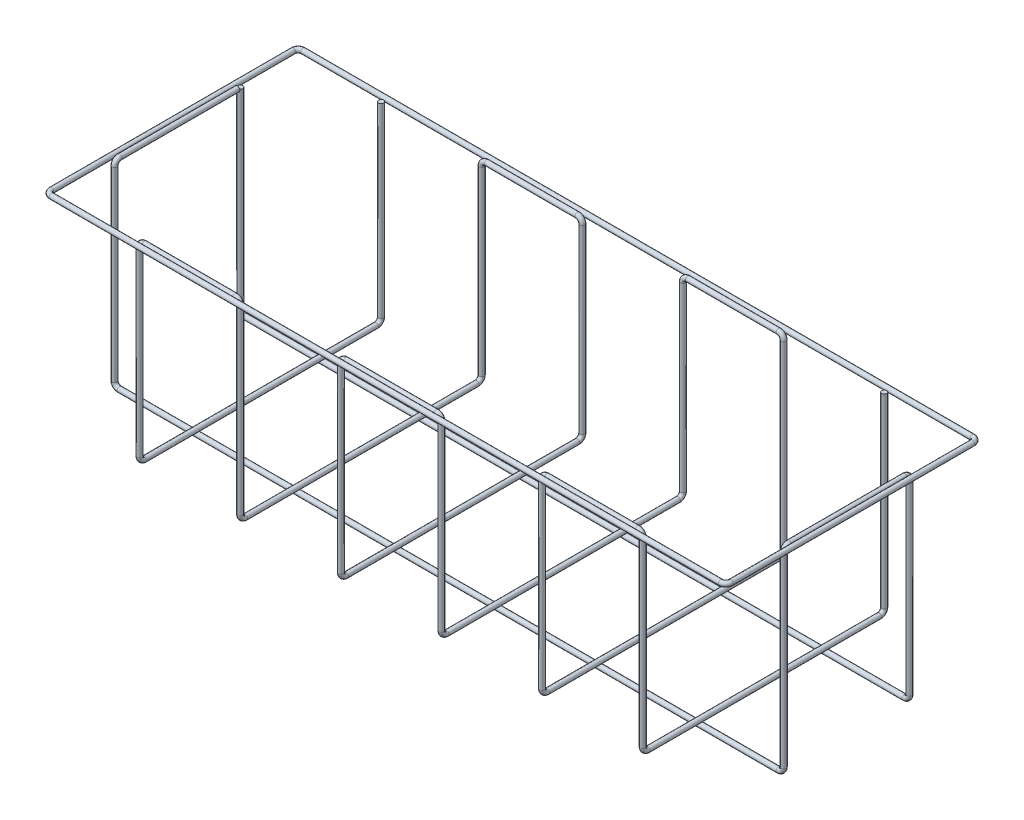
from build123d import *

# Parameters (mm, degrees)
SKETCH4_R  = 2.5
SKETCH14_R = 2.5
SKETCH15_R = 2.5


with BuildPart() as part:
    # Sweep2: sweep along a path in Sketch3
    with BuildLine(Plane(origin=(0, 0, 0), x_dir=(1, 0, 0), z_dir=(0, 1, 0))) as sweep2_path:
        Line((332.5, -125), (-332.5, -125))
        ThreePointArc((-332.5, -125), (-336.035533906, -123.535533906), (-337.5, -120))
        Line((-337.5, -120), (-337.5, 120))
        ThreePointArc((-337.5, 120), (-336.035533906, 123.535533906), (-332.5, 125))
        Line((-332.5, 125), (332.5, 125))
        ThreePointArc((332.5, 125), (336.035533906, 123.535533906), (337.5, 120))
        Line((337.5, 120), (337.5, -120))
        ThreePointArc((337.5, -120), (336.035533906, -123.535533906), (332.5, -125))
    # Sketch4 → Sweep2 (sweep)
    with BuildSketch(Plane(origin=(0, 0, 0), x_dir=(0, 0, -1), z_dir=(1, 0, 0))):
        with Locations((-125, 0)):
            Circle(SKETCH4_R)
    sweep(path=sweep2_path.line)


with BuildPart() as body_2:
    # Sweep9: sweep along a curve in space
    with BuildLine() as sweep9_path:
        Line((-332.5, 0, -62.5), (-332.5, -190, -62.5))
        ThreePointArc((-332.5, -190, -62.5), (-331.035533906, -193.535533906, -62.5), (-327.5, -195, -62.5))
        Line((-327.5, -195, -62.5), (327.5, -195, -62.5))
        ThreePointArc((327.5, -195, -62.5), (331.035533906, -193.535533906, -62.5), (332.5, -190, -62.5))
        Line((332.5, -190, -62.5), (332.5, -5, -62.5))
        ThreePointArc((332.5, -5, -62.5), (332.5, -1.464466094, -61.035533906), (332.5, 0, -57.5))
        Line((332.5, 0, -57.5), (332.5, 0, 57.5))
        ThreePointArc((332.5, 0, 57.5), (332.5, -1.464466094, 61.035533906), (332.5, -5, 62.5))
        Line((332.5, -5, 62.5), (332.5, -190, 62.5))
        ThreePointArc((332.5, -190, 62.5), (331.035533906, -193.535533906, 62.5), (327.5, -195, 62.5))
        Line((327.5, -195, 62.5), (-327.5, -195, 62.5))
        ThreePointArc((-327.5, -195, 62.5), (-331.035533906, -193.535533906, 62.5), (-332.5, -190, 62.5))
        Line((-332.5, -190, 62.5), (-332.5, -5, 62.5))
        ThreePointArc((-332.5, -5, 62.5), (-332.5, -1.464466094, 61.035533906), (-332.5, 0, 57.5))
        Line((-332.5, 0, 57.5), (-332.5, 0, -59.5))
    # Sketch14 → Sweep9 (sweep)
    with BuildSketch(Plane(origin=(0, 0, 0), x_dir=(1, 0, 0), z_dir=(0, 1, 0))):
        with Locations((-332.5, 62.5)):
            Circle(SKETCH14_R)
    sweep(path=sweep9_path.line)


with BuildPart() as body_3:
    # Sweep10: sweep along a curve in space
    with BuildLine() as sweep10_path:
        Line((-250.1, 0, -120), (-250.1, -185, -120))
        ThreePointArc((-250.1, -185, -120), (-250.1, -188.535533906, -118.535533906), (-250.1, -190, -115))
        Line((-250.1, -190, -115), (-250.1, -190, 115))
        ThreePointArc((-250.1, -190, 115), (-250.1, -188.535533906, 118.535533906), (-250.1, -185, 120))
        Line((-250.1, -185, 120), (-250.1, -5, 120))
        ThreePointArc((-250.1, -5, 120), (-248.635533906, -1.464466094, 120), (-245.1, 0, 120))
        Line((-245.1, 0, 120), (-155.1, 0, 120))
        ThreePointArc((-155.1, 0, 120), (-151.564466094, -1.464466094, 120), (-150.1, -5, 120))
        Line((-150.1, -5, 120), (-150.1, -185, 120))
        ThreePointArc((-150.1, -185, 120), (-150.1, -188.535533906, 118.535533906), (-150.1, -190, 115))
        Line((-150.1, -190, 115), (-150.1, -190, -115))
        ThreePointArc((-150.1, -190, -115), (-150.1, -188.535533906, -118.535533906), (-150.1, -185, -120))
        Line((-150.1, -185, -120), (-150.1, -5, -120))
        ThreePointArc((-150.1, -5, -120), (-148.635533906, -1.464466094, -120), (-145.1, 0, -120))
        Line((-145.1, 0, -120), (-55.1, 0, -120))
        ThreePointArc((-55.1, 0, -120), (-51.564466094, -1.464466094, -120), (-50.1, -5, -120))
        Line((-50.1, -5, -120), (-50.1, -185, -120))
        ThreePointArc((-50.1, -185, -120), (-50.1, -188.535533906, -118.535533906), (-50.1, -190, -115))
        Line((-50.1, -190, -115), (-50.1, -190, 115))
        ThreePointArc((-50.1, -190, 115), (-50.1, -188.535533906, 118.535533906), (-50.1, -185, 120))
        Line((-50.1, -185, 120), (-50.1, -5, 120))
        ThreePointArc((-50.1, -5, 120), (-48.635533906, -1.464466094, 120), (-45.1, 0, 120))
        Line((-45.1, 0, 120), (44.9, 0, 120))
        ThreePointArc((44.9, 0, 120), (48.435533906, -1.464466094, 120), (49.9, -5, 120))
        Line((49.9, -5, 120), (49.9, -185, 120))
        ThreePointArc((49.9, -185, 120), (49.9, -188.535533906, 118.535533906), (49.9, -190, 115))
        Line((49.9, -190, 115), (49.9, -190, -115))
        ThreePointArc((49.9, -190, -115), (49.9, -188.535533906, -118.535533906), (49.9, -185, -120))
        Line((49.9, -185, -120), (49.9, -5, -120))
        ThreePointArc((49.9, -5, -120), (51.364466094, -1.464466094, -120), (54.9, 0, -120))
        Line((54.9, 0, -120), (144.9, 0, -120))
        ThreePointArc((144.9, 0, -120), (148.435533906, -1.464466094, -120), (149.9, -5, -120))
        Line((149.9, -5, -120), (149.9, -185, -120))
        ThreePointArc((149.9, -185, -120), (149.9, -188.535533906, -118.535533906), (149.9, -190, -115))
        Line((149.9, -190, -115), (149.9, -190, 115))
        ThreePointArc((149.9, -190, 115), (149.9, -188.535533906, 118.535533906), (149.9, -185, 120))
        Line((149.9, -185, 120), (149.9, -5, 120))
        ThreePointArc((149.9, -5, 120), (151.364466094, -1.464466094, 120), (154.9, 0, 120))
        Line((154.9, 0, 120), (244.9, 0, 120))
        ThreePointArc((244.9, 0, 120), (248.435533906, -1.464466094, 120), (249.9, -5, 120))
        Line((249.9, -5, 120), (249.9, -185, 120))
        ThreePointArc((249.9, -185, 120), (249.9, -188.535533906, 118.535533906), (249.9, -190, 115))
        Line((249.9, -190, 115), (249.9, -190, -115))
        ThreePointArc((249.9, -190, -115), (249.9, -188.535533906, -118.535533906), (249.9, -185, -120))
        Line((249.9, -185, -120), (249.9, 0, -120))
    # Sketch15 → Sweep10 (sweep)
    with BuildSketch(Plane(origin=(0, 0, 0), x_dir=(1, 0, 0), z_dir=(0, 1, 0))):
        with Locations((-250.1, 120)):
            Circle(SKETCH15_R)
    sweep(path=sweep10_path.line)


solid = Compound([part.part, body_2.part, body_3.part])
